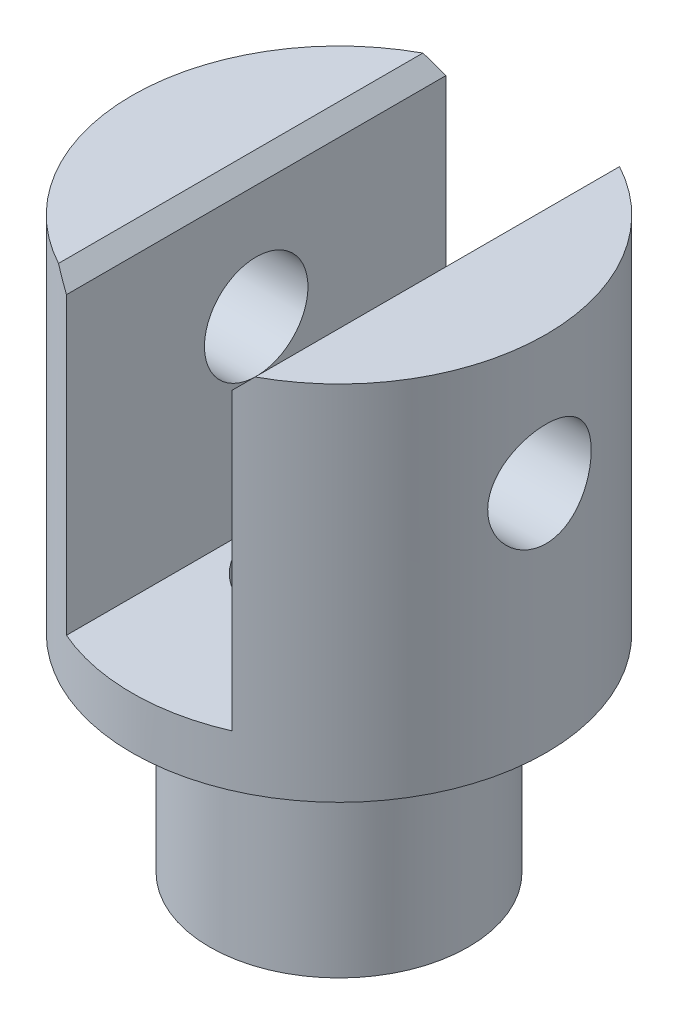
ISO-10303-21;
HEADER;
FILE_DESCRIPTION(('STEP AP214'),'2;1');
FILE_NAME('part.step','',(''),(''),'','','');
FILE_SCHEMA(('AUTOMOTIVE_DESIGN { 1 0 10303 214 1 1 1 1 }'));
ENDSEC;
DATA;
#1=APPLICATION_CONTEXT('core data for automotive mechanical design processes');
#2=APPLICATION_PROTOCOL_DEFINITION('international standard','automotive_design',2000,#1);
#3=PRODUCT_CONTEXT('',#1,'mechanical');
#4=PRODUCT('Part','Part','',(#3));
#5=PRODUCT_RELATED_PRODUCT_CATEGORY('part','',(#4));
#6=PRODUCT_DEFINITION_FORMATION('','',#4);
#7=PRODUCT_DEFINITION_CONTEXT('part definition',#1,'design');
#8=PRODUCT_DEFINITION('design','',#6,#7);
#9=PRODUCT_DEFINITION_SHAPE('','',#8);
#10=(LENGTH_UNIT() NAMED_UNIT(*) SI_UNIT(.MILLI.,.METRE.));
#11=(NAMED_UNIT(*) PLANE_ANGLE_UNIT() SI_UNIT($,.RADIAN.));
#12=(NAMED_UNIT(*) SI_UNIT($,.STERADIAN.) SOLID_ANGLE_UNIT());
#13=UNCERTAINTY_MEASURE_WITH_UNIT(LENGTH_MEASURE(1.E-05),#10,'distance_accuracy_value','');
#14=(GEOMETRIC_REPRESENTATION_CONTEXT(3) GLOBAL_UNCERTAINTY_ASSIGNED_CONTEXT((#13)) GLOBAL_UNIT_ASSIGNED_CONTEXT((#10,
#11,#12)) REPRESENTATION_CONTEXT('',''));
#15=CARTESIAN_POINT('',(0.,0.,0.));
#16=DIRECTION('',(0.,0.,1.));
#17=DIRECTION('',(1.,0.,0.));
#18=AXIS2_PLACEMENT_3D('',#15,#16,#17);
#19=CARTESIAN_POINT('',(0.,7.,0.));
#20=DIRECTION('',(0.,1.,0.));
#21=DIRECTION('',(0.,0.,1.));
#22=AXIS2_PLACEMENT_3D('',#19,#20,#21);
#23=PLANE('',#22);
#24=CARTESIAN_POINT('',(0.,7.,0.));
#25=DIRECTION('',(0.,1.,0.));
#26=DIRECTION('',(0.,0.,1.));
#27=AXIS2_PLACEMENT_3D('',#24,#25,#26);
#28=CIRCLE('',#27,4.);
#29=CARTESIAN_POINT('',(1.9,7.,3.51994318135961));
#30=VERTEX_POINT('',#29);
#31=CARTESIAN_POINT('',(1.9,7.,-3.51994318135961));
#32=VERTEX_POINT('',#31);
#33=EDGE_CURVE('E128',#30,#32,#28,.T.);
#34=ORIENTED_EDGE('',*,*,#33,.T.);
#35=DIRECTION('',(0.,0.,1.));
#36=VECTOR('',#35,1.);
#37=CARTESIAN_POINT('',(1.9,7.,3.66606055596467));
#38=LINE('',#37,#36);
#39=EDGE_CURVE('E11',#32,#30,#38,.T.);
#40=ORIENTED_EDGE('',*,*,#39,.T.);
#41=EDGE_LOOP('',(#34,#40));
#42=FACE_BOUND('',#41,.T.);
#43=ADVANCED_FACE('F34',(#42),#23,.T.);
#44=CARTESIAN_POINT('',(0.,7.,0.));
#45=DIRECTION('',(0.,-1.,0.));
#46=DIRECTION('',(0.,0.,-1.));
#47=AXIS2_PLACEMENT_3D('',#44,#45,#46);
#48=CYLINDRICAL_SURFACE('',#47,4.);
#49=CARTESIAN_POINT('',(4.,3.50000000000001,0.));
#50=CARTESIAN_POINT('',(3.99999906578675,3.50000155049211,0.0552507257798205));
#51=CARTESIAN_POINT('',(3.99884385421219,3.50459436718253,0.110518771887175));
#52=CARTESIAN_POINT('',(3.99434742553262,3.52281676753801,0.219470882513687));
#53=CARTESIAN_POINT('',(3.99100496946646,3.53645147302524,0.273154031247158));
#54=CARTESIAN_POINT('',(3.98250417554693,3.5722928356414,0.377347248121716));
#55=CARTESIAN_POINT('',(3.97734801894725,3.59448919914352,0.427861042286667));
#56=CARTESIAN_POINT('',(3.96576895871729,3.64678759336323,0.524448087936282));
#57=CARTESIAN_POINT('',(3.95934601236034,3.67688989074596,0.570521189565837));
#58=CARTESIAN_POINT('',(3.94578275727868,3.74480052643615,0.657867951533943));
#59=CARTESIAN_POINT('',(3.93863138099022,3.78274104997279,0.699037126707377));
#60=CARTESIAN_POINT('',(3.92449080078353,3.86496813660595,0.774499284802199));
#61=CARTESIAN_POINT('',(3.91750161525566,3.90925541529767,0.808791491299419));
#62=CARTESIAN_POINT('',(3.9043651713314,4.00373015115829,0.87001769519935));
#63=CARTESIAN_POINT('',(3.89823196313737,4.05399548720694,0.896834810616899));
#64=CARTESIAN_POINT('',(3.88766329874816,4.15849894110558,0.94159793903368));
#65=CARTESIAN_POINT('',(3.88322757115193,4.21273642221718,0.959545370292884));
#66=CARTESIAN_POINT('',(3.87666984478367,4.32249566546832,0.985703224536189));
#67=CARTESIAN_POINT('',(3.87450327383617,4.37796993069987,0.994101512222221));
#68=CARTESIAN_POINT('',(3.87259575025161,4.48957904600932,1.00150785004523));
#69=CARTESIAN_POINT('',(3.87285440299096,4.54571378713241,1.00051742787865));
#70=CARTESIAN_POINT('',(3.87572803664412,4.65561053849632,0.989324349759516));
#71=CARTESIAN_POINT('',(3.87828575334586,4.70939708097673,0.979345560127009));
#72=CARTESIAN_POINT('',(3.88537806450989,4.81450736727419,0.950816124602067));
#73=CARTESIAN_POINT('',(3.88991279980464,4.86583093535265,0.932264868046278));
#74=CARTESIAN_POINT('',(3.90050075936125,4.96515867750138,0.886926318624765));
#75=CARTESIAN_POINT('',(3.90656884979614,5.01312411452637,0.86005777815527));
#76=CARTESIAN_POINT('',(3.91953140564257,5.10394580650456,0.798904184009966));
#77=CARTESIAN_POINT('',(3.9264260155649,5.14680116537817,0.764617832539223));
#78=CARTESIAN_POINT('',(3.94050587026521,5.2274690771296,0.688442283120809));
#79=CARTESIAN_POINT('',(3.94769379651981,5.26510299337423,0.64636417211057));
#80=CARTESIAN_POINT('',(3.96137310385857,5.3328141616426,0.556407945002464));
#81=CARTESIAN_POINT('',(3.96786446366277,5.36289118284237,0.508529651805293));
#82=CARTESIAN_POINT('',(3.97945154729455,5.41470039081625,0.408077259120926));
#83=CARTESIAN_POINT('',(3.9845424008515,5.43640356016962,0.355487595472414));
#84=CARTESIAN_POINT('',(3.99271944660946,5.47061153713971,0.247250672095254));
#85=CARTESIAN_POINT('',(3.99580602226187,5.48311810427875,0.191603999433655));
#86=CARTESIAN_POINT('',(3.9995699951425,5.49830504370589,0.0803599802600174));
#87=CARTESIAN_POINT('',(4.00030702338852,5.5012286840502,0.0247978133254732));
#88=CARTESIAN_POINT('',(3.999458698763,5.49783399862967,-0.0860219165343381));
#89=CARTESIAN_POINT('',(3.99787355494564,5.49151650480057,-0.141279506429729));
#90=CARTESIAN_POINT('',(3.99259720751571,5.47001939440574,-0.249076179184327));
#91=CARTESIAN_POINT('',(3.98893756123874,5.45497249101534,-0.301643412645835));
#92=CARTESIAN_POINT('',(3.97992471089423,5.41659527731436,-0.403504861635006));
#93=CARTESIAN_POINT('',(3.97457133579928,5.39326413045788,-0.452798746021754));
#94=CARTESIAN_POINT('',(3.96262205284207,5.33850924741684,-0.547682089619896));
#95=CARTESIAN_POINT('',(3.95600578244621,5.30694925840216,-0.593190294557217));
#96=CARTESIAN_POINT('',(3.94229672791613,5.23680672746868,-0.678351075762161));
#97=CARTESIAN_POINT('',(3.93520386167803,5.19822297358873,-0.718002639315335));
#98=CARTESIAN_POINT('',(3.92112637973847,5.11399869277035,-0.791327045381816));
#99=CARTESIAN_POINT('',(3.91414869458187,5.06820819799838,-0.824829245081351));
#100=CARTESIAN_POINT('',(3.90128585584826,4.97151157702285,-0.883673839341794));
#101=CARTESIAN_POINT('',(3.89540065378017,4.92060567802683,-0.909016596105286));
#102=CARTESIAN_POINT('',(3.88545396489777,4.81539618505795,-0.95063428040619));
#103=CARTESIAN_POINT('',(3.88138170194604,4.76111491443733,-0.966962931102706));
#104=CARTESIAN_POINT('',(3.87551162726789,4.65046024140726,-0.990230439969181));
#105=CARTESIAN_POINT('',(3.87371331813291,4.59408729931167,-0.997171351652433));
#106=CARTESIAN_POINT('',(3.87263267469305,4.48258598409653,-1.00135906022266));
#107=CARTESIAN_POINT('',(3.87327955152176,4.42746837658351,-0.998878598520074));
#108=CARTESIAN_POINT('',(3.87685272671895,4.31846407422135,-0.984918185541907));
#109=CARTESIAN_POINT('',(3.87977897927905,4.26457735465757,-0.973438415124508));
#110=CARTESIAN_POINT('',(3.88754173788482,4.15986102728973,-0.941954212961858));
#111=CARTESIAN_POINT('',(3.89236676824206,4.10901512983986,-0.922000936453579));
#112=CARTESIAN_POINT('',(3.90338503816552,4.01135641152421,-0.874176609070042));
#113=CARTESIAN_POINT('',(3.90957846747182,3.96454415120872,-0.846304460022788));
#114=CARTESIAN_POINT('',(3.92283756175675,3.87496358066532,-0.78257849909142));
#115=CARTESIAN_POINT('',(3.92992176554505,3.83233261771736,-0.7465354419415));
#116=CARTESIAN_POINT('',(3.94405351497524,3.75363530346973,-0.667859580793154));
#117=CARTESIAN_POINT('',(3.95110105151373,3.71757051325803,-0.625225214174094));
#118=CARTESIAN_POINT('',(3.96451770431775,3.65239246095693,-0.533645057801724));
#119=CARTESIAN_POINT('',(3.97087222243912,3.62341692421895,-0.484598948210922));
#120=CARTESIAN_POINT('',(3.98203283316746,3.57416835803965,-0.382177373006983));
#121=CARTESIAN_POINT('',(3.98684003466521,3.55388909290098,-0.328805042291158));
#122=CARTESIAN_POINT('',(3.99365373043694,3.52561877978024,-0.229606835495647));
#123=CARTESIAN_POINT('',(3.9960172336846,3.51603250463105,-0.184253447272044));
#124=CARTESIAN_POINT('',(3.99919070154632,3.50322270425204,-0.0926040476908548));
#125=CARTESIAN_POINT('',(4.00000078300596,3.49999870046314,-0.0463081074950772));
#126=CARTESIAN_POINT('',(4.,3.50000000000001,0.));
#127=B_SPLINE_CURVE_WITH_KNOTS('',3,(#49,#50,#51,#52,#53,#54,#55,#56,#57,#58,#59,#60,#61,#62,
#63,#64,#65,#66,#67,#68,#69,#70,#71,#72,#73,#74,#75,#76,#77,#78,#79,#80,#81,#82,#83,#84,#85,#86,
#87,#88,#89,#90,#91,#92,#93,#94,#95,#96,#97,#98,#99,#100,#101,#102,#103,#104,#105,#106,#107,
#108,#109,#110,#111,#112,#113,#114,#115,#116,#117,#118,#119,#120,#121,#122,#123,#124,#125,#126),
.UNSPECIFIED.,.T.,.F.,(4,2,2,2,2,2,2,2,2,2,2,2,2,2,2,2,2,2,2,2,2,2,2,2,2,2,2,2,2,2,2,2,2,2,2,2,
2,2,4),(0.,0.165582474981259,0.331258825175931,0.496736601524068,0.662219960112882,
0.830762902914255,0.999324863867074,1.17039098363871,1.34142974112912,1.50904196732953,
1.6766269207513,1.84014998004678,2.00368468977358,2.16887018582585,2.33408460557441,
2.50401000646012,2.67394059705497,2.84445486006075,3.0149364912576,3.18105539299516,
3.3471593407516,3.51080183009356,3.67446084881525,3.84102391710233,4.00761575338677,
4.17829672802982,4.3489701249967,4.51861503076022,4.68822282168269,4.85295853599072,
5.01769093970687,5.18144267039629,5.34521712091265,5.51326384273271,5.68135046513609,
5.85248123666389,6.0234890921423,6.1622816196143,6.30106370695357),.UNSPECIFIED.);
#128=CARTESIAN_POINT('',(4.,3.50000000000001,0.));
#129=VERTEX_POINT('',#128);
#130=EDGE_CURVE('E140',#129,#129,#127,.T.);
#131=ORIENTED_EDGE('',*,*,#130,.T.);
#132=EDGE_LOOP('',(#131));
#133=FACE_BOUND('',#132,.T.);
#134=CARTESIAN_POINT('',(-3.87298334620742,4.5,0.999999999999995));
#135=CARTESIAN_POINT('',(-3.87298440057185,4.44477969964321,0.999998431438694));
#136=CARTESIAN_POINT('',(-3.87417722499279,4.38954204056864,0.995410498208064));
#137=CARTESIAN_POINT('',(-3.87880744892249,4.28065296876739,0.977209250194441));
#138=CARTESIAN_POINT('',(-3.88224615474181,4.22700249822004,0.963590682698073));
#139=CARTESIAN_POINT('',(-3.89095489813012,4.12287858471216,0.92779647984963));
#140=CARTESIAN_POINT('',(-3.8962225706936,4.07240113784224,0.905631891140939));
#141=CARTESIAN_POINT('',(-3.90799276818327,3.97587565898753,0.853408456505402));
#142=CARTESIAN_POINT('',(-3.91449534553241,3.92982781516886,0.823349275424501));
#143=CARTESIAN_POINT('',(-3.92816286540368,3.84245534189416,0.755483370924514));
#144=CARTESIAN_POINT('',(-3.93533839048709,3.80124255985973,0.717534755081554));
#145=CARTESIAN_POINT('',(-3.94945150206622,3.72569544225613,0.635272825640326));
#146=CARTESIAN_POINT('',(-3.95638906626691,3.69136174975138,0.590958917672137));
#147=CARTESIAN_POINT('',(-3.96936166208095,3.63008981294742,0.496458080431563));
#148=CARTESIAN_POINT('',(-3.975382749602,3.6032614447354,0.446197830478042));
#149=CARTESIAN_POINT('',(-3.9857232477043,3.55847614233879,0.341705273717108));
#150=CARTESIAN_POINT('',(-3.99004290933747,3.5405178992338,0.287473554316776));
#151=CARTESIAN_POINT('',(-3.99641903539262,3.51434086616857,0.177743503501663));
#152=CARTESIAN_POINT('',(-3.99851957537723,3.50593214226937,0.12229308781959));
#153=CARTESIAN_POINT('',(-4.00037437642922,3.49849664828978,0.0107315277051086));
#154=CARTESIAN_POINT('',(-4.00012898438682,3.49946849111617,-0.0453795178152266));
#155=CARTESIAN_POINT('',(-3.99735237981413,3.51062994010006,-0.155352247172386));
#156=CARTESIAN_POINT('',(-3.99487200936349,3.52061453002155,-0.209236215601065));
#157=CARTESIAN_POINT('',(-3.98796334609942,3.5491885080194,-0.314538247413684));
#158=CARTESIAN_POINT('',(-3.98353494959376,3.56777835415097,-0.365956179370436));
#159=CARTESIAN_POINT('',(-3.97315003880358,3.61320102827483,-0.465406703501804));
#160=CARTESIAN_POINT('',(-3.96718007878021,3.6401068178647,-0.513404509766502));
#161=CARTESIAN_POINT('',(-3.9543596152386,3.70134227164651,-0.604275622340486));
#162=CARTESIAN_POINT('',(-3.94750895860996,3.73567322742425,-0.647148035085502));
#163=CARTESIAN_POINT('',(-3.93345485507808,3.81188349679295,-0.727774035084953));
#164=CARTESIAN_POINT('',(-3.92624687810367,3.85394195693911,-0.765357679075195));
#165=CARTESIAN_POINT('',(-3.91246017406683,3.9438399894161,-0.832976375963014));
#166=CARTESIAN_POINT('',(-3.90588147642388,3.9916798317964,-0.863011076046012));
#167=CARTESIAN_POINT('',(-3.89408198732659,4.09211601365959,-0.914788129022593));
#168=CARTESIAN_POINT('',(-3.88886793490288,4.14473429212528,-0.936489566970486));
#169=CARTESIAN_POINT('',(-3.88047456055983,4.25303418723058,-0.970685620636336));
#170=CARTESIAN_POINT('',(-3.87729480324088,4.30871514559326,-0.983182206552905));
#171=CARTESIAN_POINT('',(-3.87342142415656,4.41998380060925,-0.998331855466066));
#172=CARTESIAN_POINT('',(-3.87266435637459,4.47553511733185,-1.00123618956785));
#173=CARTESIAN_POINT('',(-3.87354937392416,4.58632877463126,-0.997806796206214));
#174=CARTESIAN_POINT('',(-3.87519123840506,4.64157114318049,-0.991473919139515));
#175=CARTESIAN_POINT('',(-3.88062832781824,4.74924570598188,-0.96997018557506));
#176=CARTESIAN_POINT('',(-3.8843878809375,4.80170909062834,-0.954945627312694));
#177=CARTESIAN_POINT('',(-3.89360287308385,4.90337258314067,-0.916647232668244));
#178=CARTESIAN_POINT('',(-3.89905851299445,4.95257230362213,-0.893372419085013));
#179=CARTESIAN_POINT('',(-3.91118454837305,5.04737651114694,-0.838708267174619));
#180=CARTESIAN_POINT('',(-3.91787667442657,5.09289153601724,-0.807168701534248));
#181=CARTESIAN_POINT('',(-3.93166833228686,5.17807534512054,-0.737060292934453));
#182=CARTESIAN_POINT('',(-3.93876793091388,5.21774316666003,-0.698490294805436));
#183=CARTESIAN_POINT('',(-3.95278961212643,5.29112441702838,-0.614262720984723));
#184=CARTESIAN_POINT('',(-3.95970280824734,5.32466402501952,-0.56845195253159));
#185=CARTESIAN_POINT('',(-3.97238886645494,5.38357434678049,-0.471702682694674));
#186=CARTESIAN_POINT('',(-3.97816178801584,5.40894548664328,-0.420764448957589));
#187=CARTESIAN_POINT('',(-3.98788046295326,5.45057841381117,-0.315558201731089));
#188=CARTESIAN_POINT('',(-3.99183932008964,5.46690571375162,-0.26131738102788));
#189=CARTESIAN_POINT('',(-3.99754117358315,5.49018413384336,-0.150749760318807));
#190=CARTESIAN_POINT('',(-3.99928459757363,5.49713706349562,-0.0944233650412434));
#191=CARTESIAN_POINT('',(-4.00034169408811,5.50136758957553,0.0170835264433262));
#192=CARTESIAN_POINT('',(-3.99971978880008,5.49890170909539,0.072253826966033));
#193=CARTESIAN_POINT('',(-3.99625896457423,5.48495217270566,0.181367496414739));
#194=CARTESIAN_POINT('',(-3.99342011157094,5.47346878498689,0.235310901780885));
#195=CARTESIAN_POINT('',(-3.98585432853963,5.44194778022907,0.340171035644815));
#196=CARTESIAN_POINT('',(-3.98113764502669,5.42195654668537,0.391102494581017));
#197=CARTESIAN_POINT('',(-3.97031288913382,5.37402942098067,0.488917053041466));
#198=CARTESIAN_POINT('',(-3.96420464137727,5.34609252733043,0.535799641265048));
#199=CARTESIAN_POINT('',(-3.95107249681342,5.28228476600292,0.625401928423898));
#200=CARTESIAN_POINT('',(-3.94403016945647,5.24623985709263,0.667994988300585));
#201=CARTESIAN_POINT('',(-3.92990649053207,5.16757714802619,0.746615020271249));
#202=CARTESIAN_POINT('',(-3.92282512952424,5.12495768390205,0.782640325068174));
#203=CARTESIAN_POINT('',(-3.90927475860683,5.0333985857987,0.847762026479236));
#204=CARTESIAN_POINT('',(-3.90281963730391,4.98435587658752,0.876716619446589));
#205=CARTESIAN_POINT('',(-3.8914395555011,4.88194451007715,0.925926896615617));
#206=CARTESIAN_POINT('',(-3.88651348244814,4.82857903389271,0.946188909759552));
#207=CARTESIAN_POINT('',(-3.87951908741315,4.72942298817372,0.974422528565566));
#208=CARTESIAN_POINT('',(-3.87708663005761,4.68410683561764,0.983993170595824));
#209=CARTESIAN_POINT('',(-3.87381838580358,4.59253113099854,0.996782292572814));
#210=CARTESIAN_POINT('',(-3.87298246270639,4.54627165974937,1.00000131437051));
#211=CARTESIAN_POINT('',(-3.87298334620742,4.5,0.999999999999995));
#212=B_SPLINE_CURVE_WITH_KNOTS('',3,(#134,#135,#136,#137,#138,#139,#140,#141,#142,#143,#144,
#145,#146,#147,#148,#149,#150,#151,#152,#153,#154,#155,#156,#157,#158,#159,#160,#161,#162,#163,
#164,#165,#166,#167,#168,#169,#170,#171,#172,#173,#174,#175,#176,#177,#178,#179,#180,#181,#182,
#183,#184,#185,#186,#187,#188,#189,#190,#191,#192,#193,#194,#195,#196,#197,#198,#199,#200,#201,
#202,#203,#204,#205,#206,#207,#208,#209,#210,#211),.UNSPECIFIED.,.T.,.F.,(4,2,2,2,2,2,2,2,2,2,2,
2,2,2,2,2,2,2,2,2,2,2,2,2,2,2,2,2,2,2,2,2,2,2,2,2,2,2,4),(0.,0.16549097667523,0.331078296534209,
0.49645229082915,0.661833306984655,0.830495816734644,0.999174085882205,1.17020598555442,
1.34121263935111,1.50875500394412,1.67627259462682,1.84007305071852,2.00388222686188,
2.16917149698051,2.33448954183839,2.50428186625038,2.67408212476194,2.84470572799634,
3.01529280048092,3.1813742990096,3.34744050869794,3.51078961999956,3.6741580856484,
3.84073138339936,4.0073320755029,4.178101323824,4.34886166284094,4.51836829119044,
4.68784219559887,4.85273378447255,5.01762046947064,5.18161950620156,5.34563922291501,
5.513588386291,5.68158012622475,5.85270590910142,6.02370688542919,6.16239130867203,
6.3010639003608),.UNSPECIFIED.);
#213=CARTESIAN_POINT('',(-3.87298334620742,4.5,0.999999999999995));
#214=VERTEX_POINT('',#213);
#215=EDGE_CURVE('E109',#214,#214,#212,.T.);
#216=ORIENTED_EDGE('',*,*,#215,.T.);
#217=EDGE_LOOP('',(#216));
#218=FACE_BOUND('',#217,.T.);
#219=DIRECTION('',(0.,-1.,0.));
#220=VECTOR('',#219,1.);
#221=CARTESIAN_POINT('',(-1.6,7.,3.66606055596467));
#222=LINE('',#221,#220);
#223=CARTESIAN_POINT('',(-1.6,1.,3.66606055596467));
#224=VERTEX_POINT('',#223);
#225=CARTESIAN_POINT('',(-1.6,6.7,3.66606055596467));
#226=VERTEX_POINT('',#225);
#227=EDGE_CURVE('E98',#224,#226,#222,.F.);
#228=ORIENTED_EDGE('',*,*,#227,.T.);
#229=CARTESIAN_POINT('',(0.,5.1,0.));
#230=DIRECTION('',(0.707106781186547,0.707106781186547,0.));
#231=DIRECTION('',(0.707106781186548,-0.707106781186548,0.));
#232=AXIS2_PLACEMENT_3D('',#229,#230,#231);
#233=ELLIPSE('',#232,5.65685424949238,4.);
#234=CARTESIAN_POINT('',(-1.9,7.,3.51994318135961));
#235=VERTEX_POINT('',#234);
#236=EDGE_CURVE('E49',#226,#235,#233,.F.);
#237=ORIENTED_EDGE('',*,*,#236,.T.);
#238=CARTESIAN_POINT('',(-1.9,7.,-3.51994318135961));
#239=VERTEX_POINT('',#238);
#240=EDGE_CURVE('E126',#239,#235,#28,.T.);
#241=ORIENTED_EDGE('',*,*,#240,.F.);
#242=CARTESIAN_POINT('',(0.,5.1,0.));
#243=DIRECTION('',(0.707106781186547,0.707106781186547,0.));
#244=DIRECTION('',(0.707106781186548,-0.707106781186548,0.));
#245=AXIS2_PLACEMENT_3D('',#242,#243,#244);
#246=ELLIPSE('',#245,5.65685424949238,4.);
#247=CARTESIAN_POINT('',(-1.6,6.7,-3.66606055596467));
#248=VERTEX_POINT('',#247);
#249=EDGE_CURVE('E92',#239,#248,#246,.F.);
#250=ORIENTED_EDGE('',*,*,#249,.T.);
#251=DIRECTION('',(0.,-1.,0.));
#252=VECTOR('',#251,1.);
#253=CARTESIAN_POINT('',(-1.6,7.,-3.66606055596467));
#254=LINE('',#253,#252);
#255=CARTESIAN_POINT('',(-1.6,1.,-3.66606055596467));
#256=VERTEX_POINT('',#255);
#257=EDGE_CURVE('E85',#248,#256,#254,.T.);
#258=ORIENTED_EDGE('',*,*,#257,.T.);
#259=CARTESIAN_POINT('',(0.,1.,0.));
#260=DIRECTION('',(0.,1.,0.));
#261=DIRECTION('',(0.,0.,1.));
#262=AXIS2_PLACEMENT_3D('',#259,#260,#261);
#263=CIRCLE('',#262,4.);
#264=CARTESIAN_POINT('',(1.6,1.,-3.66606055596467));
#265=VERTEX_POINT('',#264);
#266=EDGE_CURVE('E90',#265,#256,#263,.T.);
#267=ORIENTED_EDGE('',*,*,#266,.F.);
#268=DIRECTION('',(0.,-1.,0.));
#269=VECTOR('',#268,1.);
#270=CARTESIAN_POINT('',(1.6,7.,-3.66606055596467));
#271=LINE('',#270,#269);
#272=CARTESIAN_POINT('',(1.6,6.7,-3.66606055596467));
#273=VERTEX_POINT('',#272);
#274=EDGE_CURVE('E97',#265,#273,#271,.F.);
#275=ORIENTED_EDGE('',*,*,#274,.T.);
#276=CARTESIAN_POINT('',(0.,5.10000000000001,0.));
#277=DIRECTION('',(-0.707106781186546,0.707106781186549,0.));
#278=DIRECTION('',(-0.707106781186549,-0.707106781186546,0.));
#279=AXIS2_PLACEMENT_3D('',#276,#277,#278);
#280=ELLIPSE('',#279,5.65685424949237,4.);
#281=EDGE_CURVE('E196',#273,#32,#280,.F.);
#282=ORIENTED_EDGE('',*,*,#281,.T.);
#283=ORIENTED_EDGE('',*,*,#33,.F.);
#284=CARTESIAN_POINT('',(0.,5.10000000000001,0.));
#285=DIRECTION('',(-0.707106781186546,0.707106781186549,0.));
#286=DIRECTION('',(-0.707106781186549,-0.707106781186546,0.));
#287=AXIS2_PLACEMENT_3D('',#284,#285,#286);
#288=ELLIPSE('',#287,5.65685424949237,4.);
#289=CARTESIAN_POINT('',(1.6,6.7,3.66606055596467));
#290=VERTEX_POINT('',#289);
#291=EDGE_CURVE('E198',#30,#290,#288,.F.);
#292=ORIENTED_EDGE('',*,*,#291,.T.);
#293=DIRECTION('',(0.,-1.,0.));
#294=VECTOR('',#293,1.);
#295=CARTESIAN_POINT('',(1.6,7.,3.66606055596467));
#296=LINE('',#295,#294);
#297=CARTESIAN_POINT('',(1.6,1.,3.66606055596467));
#298=VERTEX_POINT('',#297);
#299=EDGE_CURVE('E120',#290,#298,#296,.T.);
#300=ORIENTED_EDGE('',*,*,#299,.T.);
#301=EDGE_CURVE('E110',#224,#298,#263,.T.);
#302=ORIENTED_EDGE('',*,*,#301,.F.);
#303=EDGE_LOOP('',(#228,#237,#241,#250,#258,#267,#275,#282,#283,#292,#300,#302));
#304=FACE_BOUND('',#303,.T.);
#305=CARTESIAN_POINT('',(0.,0.,0.));
#306=DIRECTION('',(0.,1.,0.));
#307=DIRECTION('',(0.,0.,1.));
#308=AXIS2_PLACEMENT_3D('',#305,#306,#307);
#309=CIRCLE('',#308,4.);
#310=CARTESIAN_POINT('',(0.,0.,4.));
#311=VERTEX_POINT('',#310);
#312=EDGE_CURVE('E125',#311,#311,#309,.T.);
#313=ORIENTED_EDGE('',*,*,#312,.T.);
#314=EDGE_LOOP('',(#313));
#315=FACE_BOUND('',#314,.T.);
#316=ADVANCED_FACE('F87',(#133,#218,#304,#315),#48,.T.);
#317=ORIENTED_EDGE('',*,*,#240,.T.);
#318=DIRECTION('',(0.,0.,-1.));
#319=VECTOR('',#318,1.);
#320=CARTESIAN_POINT('',(-1.9,7.,-3.66606055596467));
#321=LINE('',#320,#319);
#322=EDGE_CURVE('E55',#235,#239,#321,.T.);
#323=ORIENTED_EDGE('',*,*,#322,.T.);
#324=EDGE_LOOP('',(#317,#323));
#325=FACE_BOUND('',#324,.T.);
#326=ADVANCED_FACE('F176',(#325),#23,.T.);
#327=CARTESIAN_POINT('',(0.,0.,0.));
#328=DIRECTION('',(0.,1.,0.));
#329=DIRECTION('',(0.,0.,1.));
#330=AXIS2_PLACEMENT_3D('',#327,#328,#329);
#331=PLANE('',#330);
#332=CARTESIAN_POINT('',(0.,0.,0.));
#333=DIRECTION('',(0.,1.,0.));
#334=DIRECTION('',(0.,0.,1.));
#335=AXIS2_PLACEMENT_3D('',#332,#333,#334);
#336=CIRCLE('',#335,2.5);
#337=CARTESIAN_POINT('',(0.,0.,2.5));
#338=VERTEX_POINT('',#337);
#339=EDGE_CURVE('E131',#338,#338,#336,.F.);
#340=ORIENTED_EDGE('',*,*,#339,.F.);
#341=EDGE_LOOP('',(#340));
#342=FACE_BOUND('',#341,.T.);
#343=ORIENTED_EDGE('',*,*,#312,.F.);
#344=EDGE_LOOP('',(#343));
#345=FACE_BOUND('',#344,.T.);
#346=ADVANCED_FACE('F174',(#342,#345),#331,.F.);
#347=CARTESIAN_POINT('',(0.,-4.,0.));
#348=DIRECTION('',(0.,1.,0.));
#349=DIRECTION('',(0.,0.,1.));
#350=AXIS2_PLACEMENT_3D('',#347,#348,#349);
#351=CYLINDRICAL_SURFACE('',#350,2.5);
#352=CARTESIAN_POINT('',(0.,-4.,0.));
#353=DIRECTION('',(0.,-1.,0.));
#354=DIRECTION('',(0.,0.,-1.));
#355=AXIS2_PLACEMENT_3D('',#352,#353,#354);
#356=CIRCLE('',#355,2.5);
#357=CARTESIAN_POINT('',(0.,-4.,-2.5));
#358=VERTEX_POINT('',#357);
#359=EDGE_CURVE('E122',#358,#358,#356,.T.);
#360=ORIENTED_EDGE('',*,*,#359,.F.);
#361=EDGE_LOOP('',(#360));
#362=FACE_BOUND('',#361,.T.);
#363=ORIENTED_EDGE('',*,*,#339,.T.);
#364=EDGE_LOOP('',(#363));
#365=FACE_BOUND('',#364,.T.);
#366=ADVANCED_FACE('F170',(#362,#365),#351,.T.);
#367=CARTESIAN_POINT('',(0.,-4.,0.));
#368=DIRECTION('',(0.,-1.,0.));
#369=DIRECTION('',(0.,0.,-1.));
#370=AXIS2_PLACEMENT_3D('',#367,#368,#369);
#371=PLANE('',#370);
#372=CARTESIAN_POINT('',(0.,-4.,0.));
#373=DIRECTION('',(0.,-1.,0.));
#374=DIRECTION('',(0.,0.,-1.));
#375=AXIS2_PLACEMENT_3D('',#372,#373,#374);
#376=CIRCLE('',#375,1.49999999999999);
#377=CARTESIAN_POINT('',(0.,-4.,-1.49999999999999));
#378=VERTEX_POINT('',#377);
#379=EDGE_CURVE('E220',#378,#378,#376,.T.);
#380=ORIENTED_EDGE('',*,*,#379,.F.);
#381=EDGE_LOOP('',(#380));
#382=FACE_BOUND('',#381,.T.);
#383=ORIENTED_EDGE('',*,*,#359,.T.);
#384=EDGE_LOOP('',(#383));
#385=FACE_BOUND('',#384,.T.);
#386=ADVANCED_FACE('F160',(#382,#385),#371,.T.);
#387=CARTESIAN_POINT('',(0.,1.,0.));
#388=DIRECTION('',(0.,1.,0.));
#389=DIRECTION('',(0.,0.,1.));
#390=AXIS2_PLACEMENT_3D('',#387,#388,#389);
#391=PLANE('',#390);
#392=CARTESIAN_POINT('',(0.,1.,0.));
#393=DIRECTION('',(0.,1.,0.));
#394=DIRECTION('',(0.,0.,1.));
#395=AXIS2_PLACEMENT_3D('',#392,#393,#394);
#396=CIRCLE('',#395,1.5);
#397=CARTESIAN_POINT('',(0.,1.,1.5));
#398=VERTEX_POINT('',#397);
#399=EDGE_CURVE('E115',#398,#398,#396,.T.);
#400=ORIENTED_EDGE('',*,*,#399,.F.);
#401=EDGE_LOOP('',(#400));
#402=FACE_BOUND('',#401,.T.);
#403=ORIENTED_EDGE('',*,*,#266,.T.);
#404=DIRECTION('',(0.,0.,1.));
#405=VECTOR('',#404,1.);
#406=CARTESIAN_POINT('',(-1.6,1.,-4.96374285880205));
#407=LINE('',#406,#405);
#408=EDGE_CURVE('E105',#256,#224,#407,.T.);
#409=ORIENTED_EDGE('',*,*,#408,.T.);
#410=ORIENTED_EDGE('',*,*,#301,.T.);
#411=DIRECTION('',(0.,0.,-1.));
#412=VECTOR('',#411,1.);
#413=CARTESIAN_POINT('',(1.6,1.,-4.96374285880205));
#414=LINE('',#413,#412);
#415=EDGE_CURVE('E108',#298,#265,#414,.T.);
#416=ORIENTED_EDGE('',*,*,#415,.T.);
#417=EDGE_LOOP('',(#403,#409,#410,#416));
#418=FACE_BOUND('',#417,.T.);
#419=ADVANCED_FACE('F103',(#402,#418),#391,.T.);
#420=CARTESIAN_POINT('',(1.6,1.,-4.96374285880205));
#421=DIRECTION('',(1.,0.,0.));
#422=DIRECTION('',(0.,0.,-1.));
#423=AXIS2_PLACEMENT_3D('',#420,#421,#422);
#424=PLANE('',#423);
#425=CARTESIAN_POINT('',(1.6,4.5,0.));
#426=DIRECTION('',(1.,0.,0.));
#427=DIRECTION('',(0.,0.,-1.));
#428=AXIS2_PLACEMENT_3D('',#425,#426,#427);
#429=CIRCLE('',#428,0.999999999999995);
#430=CARTESIAN_POINT('',(1.6,4.5,-0.999999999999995));
#431=VERTEX_POINT('',#430);
#432=EDGE_CURVE('E216',#431,#431,#429,.T.);
#433=ORIENTED_EDGE('',*,*,#432,.T.);
#434=EDGE_LOOP('',(#433));
#435=FACE_BOUND('',#434,.T.);
#436=ORIENTED_EDGE('',*,*,#299,.F.);
#437=DIRECTION('',(0.,0.,-1.));
#438=VECTOR('',#437,1.);
#439=CARTESIAN_POINT('',(1.6,6.7,-3.66606055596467));
#440=LINE('',#439,#438);
#441=EDGE_CURVE('E42',#290,#273,#440,.T.);
#442=ORIENTED_EDGE('',*,*,#441,.T.);
#443=ORIENTED_EDGE('',*,*,#274,.F.);
#444=ORIENTED_EDGE('',*,*,#415,.F.);
#445=EDGE_LOOP('',(#436,#442,#443,#444));
#446=FACE_BOUND('',#445,.T.);
#447=ADVANCED_FACE('F159',(#435,#446),#424,.F.);
#448=CARTESIAN_POINT('',(-1.6,1.,-4.96374285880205));
#449=DIRECTION('',(-1.,0.,0.));
#450=DIRECTION('',(0.,0.,1.));
#451=AXIS2_PLACEMENT_3D('',#448,#449,#450);
#452=PLANE('',#451);
#453=CARTESIAN_POINT('',(-1.6,4.5,0.));
#454=DIRECTION('',(-1.,0.,0.));
#455=DIRECTION('',(0.,0.,1.));
#456=AXIS2_PLACEMENT_3D('',#453,#454,#455);
#457=CIRCLE('',#456,0.999999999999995);
#458=CARTESIAN_POINT('',(-1.6,4.5,0.999999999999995));
#459=VERTEX_POINT('',#458);
#460=EDGE_CURVE('E217',#459,#459,#457,.T.);
#461=ORIENTED_EDGE('',*,*,#460,.T.);
#462=EDGE_LOOP('',(#461));
#463=FACE_BOUND('',#462,.T.);
#464=ORIENTED_EDGE('',*,*,#257,.F.);
#465=DIRECTION('',(0.,0.,1.));
#466=VECTOR('',#465,1.);
#467=CARTESIAN_POINT('',(-1.6,6.7,3.66606055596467));
#468=LINE('',#467,#466);
#469=EDGE_CURVE('E200',#248,#226,#468,.T.);
#470=ORIENTED_EDGE('',*,*,#469,.T.);
#471=ORIENTED_EDGE('',*,*,#227,.F.);
#472=ORIENTED_EDGE('',*,*,#408,.F.);
#473=EDGE_LOOP('',(#464,#470,#471,#472));
#474=FACE_BOUND('',#473,.T.);
#475=ADVANCED_FACE('F112',(#463,#474),#452,.F.);
#476=CARTESIAN_POINT('',(0.,-4.,0.));
#477=DIRECTION('',(0.,-1.,0.));
#478=DIRECTION('',(0.,0.,-1.));
#479=AXIS2_PLACEMENT_3D('',#476,#477,#478);
#480=CYLINDRICAL_SURFACE('',#479,1.5);
#481=ORIENTED_EDGE('',*,*,#379,.T.);
#482=EDGE_LOOP('',(#481));
#483=FACE_BOUND('',#482,.T.);
#484=ORIENTED_EDGE('',*,*,#399,.T.);
#485=EDGE_LOOP('',(#484));
#486=FACE_BOUND('',#485,.T.);
#487=ADVANCED_FACE('F151',(#483,#486),#480,.F.);
#488=CARTESIAN_POINT('',(-4.,4.5,0.));
#489=DIRECTION('',(-1.,0.,0.));
#490=DIRECTION('',(0.,0.,1.));
#491=AXIS2_PLACEMENT_3D('',#488,#489,#490);
#492=CYLINDRICAL_SURFACE('',#491,0.999999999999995);
#493=ORIENTED_EDGE('',*,*,#215,.F.);
#494=EDGE_LOOP('',(#493));
#495=FACE_BOUND('',#494,.T.);
#496=ORIENTED_EDGE('',*,*,#460,.F.);
#497=EDGE_LOOP('',(#496));
#498=FACE_BOUND('',#497,.T.);
#499=ADVANCED_FACE('F146',(#495,#498),#492,.F.);
#500=ORIENTED_EDGE('',*,*,#130,.F.);
#501=EDGE_LOOP('',(#500));
#502=FACE_BOUND('',#501,.T.);
#503=ORIENTED_EDGE('',*,*,#432,.F.);
#504=EDGE_LOOP('',(#503));
#505=FACE_BOUND('',#504,.T.);
#506=ADVANCED_FACE('F150',(#502,#505),#492,.F.);
#507=CARTESIAN_POINT('',(-1.6,6.7,-4.96374285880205));
#508=DIRECTION('',(0.707106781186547,0.707106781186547,0.));
#509=DIRECTION('',(0.,0.,-1.));
#510=AXIS2_PLACEMENT_3D('',#507,#508,#509);
#511=PLANE('',#510);
#512=ORIENTED_EDGE('',*,*,#249,.F.);
#513=ORIENTED_EDGE('',*,*,#322,.F.);
#514=ORIENTED_EDGE('',*,*,#236,.F.);
#515=ORIENTED_EDGE('',*,*,#469,.F.);
#516=EDGE_LOOP('',(#512,#513,#514,#515));
#517=FACE_BOUND('',#516,.T.);
#518=ADVANCED_FACE('F213',(#517),#511,.T.);
#519=CARTESIAN_POINT('',(1.6,6.7,-4.96374285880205));
#520=DIRECTION('',(-0.707106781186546,0.707106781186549,0.));
#521=DIRECTION('',(0.,0.,1.));
#522=AXIS2_PLACEMENT_3D('',#519,#520,#521);
#523=PLANE('',#522);
#524=ORIENTED_EDGE('',*,*,#291,.F.);
#525=ORIENTED_EDGE('',*,*,#39,.F.);
#526=ORIENTED_EDGE('',*,*,#281,.F.);
#527=ORIENTED_EDGE('',*,*,#441,.F.);
#528=EDGE_LOOP('',(#524,#525,#526,#527));
#529=FACE_BOUND('',#528,.T.);
#530=ADVANCED_FACE('F36',(#529),#523,.T.);
#531=CLOSED_SHELL('',(#43,#316,#326,#346,#366,#386,#419,#447,#475,#487,#499,#506,#518,#530));
#532=MANIFOLD_SOLID_BREP('B2',#531);
#533=ADVANCED_BREP_SHAPE_REPRESENTATION('',(#18,#532),#14);
#534=SHAPE_DEFINITION_REPRESENTATION(#9,#533);
ENDSEC;
END-ISO-10303-21;
